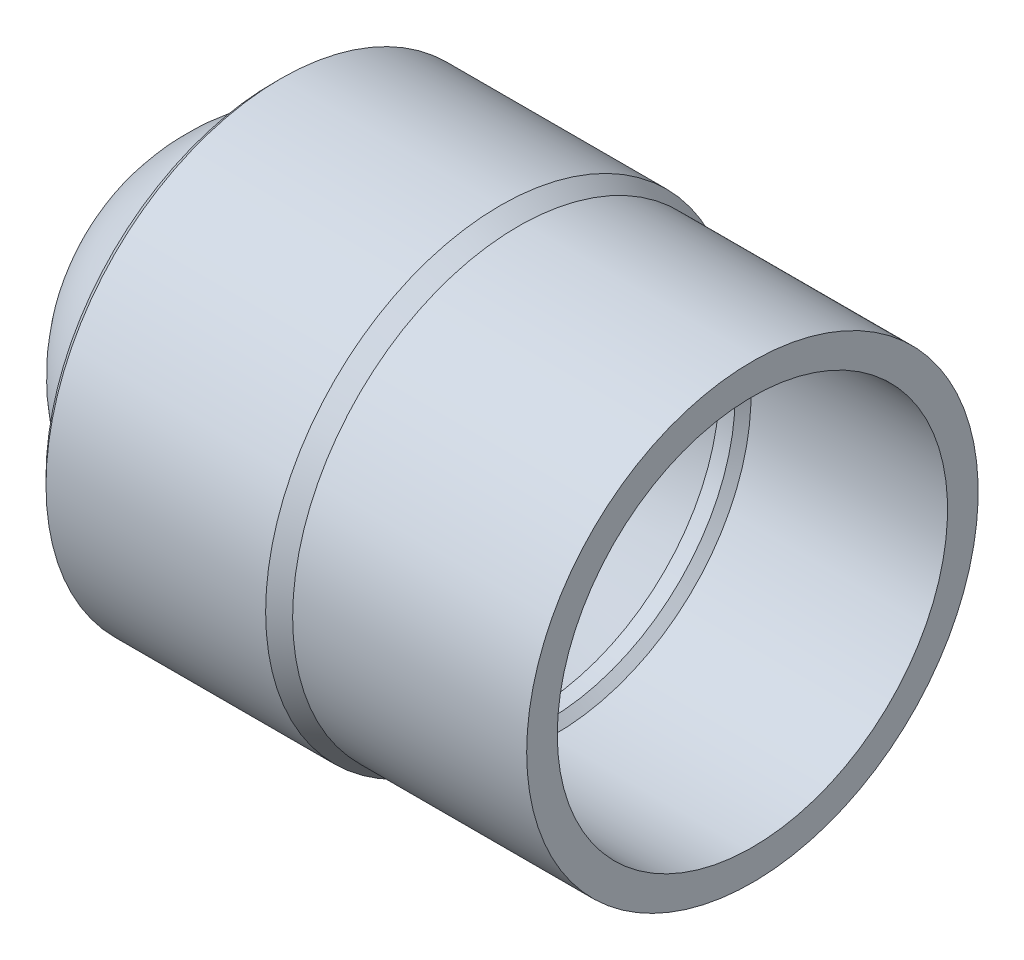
ISO-10303-21;
HEADER;
FILE_DESCRIPTION(('STEP AP214'),'2;1');
FILE_NAME('part.step','',(''),(''),'','','');
FILE_SCHEMA(('AUTOMOTIVE_DESIGN { 1 0 10303 214 1 1 1 1 }'));
ENDSEC;
DATA;
#1=APPLICATION_CONTEXT('core data for automotive mechanical design processes');
#2=APPLICATION_PROTOCOL_DEFINITION('international standard','automotive_design',2000,#1);
#3=PRODUCT_CONTEXT('',#1,'mechanical');
#4=PRODUCT('Part','Part','',(#3));
#5=PRODUCT_RELATED_PRODUCT_CATEGORY('part','',(#4));
#6=PRODUCT_DEFINITION_FORMATION('','',#4);
#7=PRODUCT_DEFINITION_CONTEXT('part definition',#1,'design');
#8=PRODUCT_DEFINITION('design','',#6,#7);
#9=PRODUCT_DEFINITION_SHAPE('','',#8);
#10=(LENGTH_UNIT() NAMED_UNIT(*) SI_UNIT(.MILLI.,.METRE.));
#11=(NAMED_UNIT(*) PLANE_ANGLE_UNIT() SI_UNIT($,.RADIAN.));
#12=(NAMED_UNIT(*) SI_UNIT($,.STERADIAN.) SOLID_ANGLE_UNIT());
#13=UNCERTAINTY_MEASURE_WITH_UNIT(LENGTH_MEASURE(1.E-05),#10,'distance_accuracy_value','');
#14=(GEOMETRIC_REPRESENTATION_CONTEXT(3) GLOBAL_UNCERTAINTY_ASSIGNED_CONTEXT((#13)) GLOBAL_UNIT_ASSIGNED_CONTEXT((#10,
#11,#12)) REPRESENTATION_CONTEXT('',''));
#15=CARTESIAN_POINT('',(0.,0.,0.));
#16=DIRECTION('',(0.,0.,1.));
#17=DIRECTION('',(1.,0.,0.));
#18=AXIS2_PLACEMENT_3D('',#15,#16,#17);
#19=CARTESIAN_POINT('',(0.,0.,0.));
#20=DIRECTION('',(-1.,0.,0.));
#21=DIRECTION('',(0.,0.,-1.));
#22=AXIS2_PLACEMENT_3D('',#19,#20,#21);
#23=SPHERICAL_SURFACE('',#22,70.104);
#24=CARTESIAN_POINT('',(0.,0.,0.));
#25=DIRECTION('',(-1.,0.,0.));
#26=DIRECTION('',(0.,0.,1.));
#27=AXIS2_PLACEMENT_3D('',#24,#25,#26);
#28=CIRCLE('',#27,70.104);
#29=CARTESIAN_POINT('',(0.,0.,70.104));
#30=VERTEX_POINT('',#29);
#31=EDGE_CURVE('E75',#30,#30,#28,.T.);
#32=ORIENTED_EDGE('',*,*,#31,.T.);
#33=EDGE_LOOP('',(#32));
#34=FACE_BOUND('',#33,.T.);
#35=ADVANCED_FACE('F32',(#34),#23,.T.);
#36=CARTESIAN_POINT('',(0.,0.,0.));
#37=DIRECTION('',(-1.,0.,0.));
#38=DIRECTION('',(0.,0.,1.));
#39=AXIS2_PLACEMENT_3D('',#36,#37,#38);
#40=SPHERICAL_SURFACE('',#39,57.404);
#41=CARTESIAN_POINT('',(0.,0.,0.));
#42=DIRECTION('',(-1.,0.,0.));
#43=DIRECTION('',(0.,0.,1.));
#44=AXIS2_PLACEMENT_3D('',#41,#42,#43);
#45=CIRCLE('',#44,57.404);
#46=CARTESIAN_POINT('',(0.,0.,57.404));
#47=VERTEX_POINT('',#46);
#48=EDGE_CURVE('E10',#47,#47,#45,.T.);
#49=ORIENTED_EDGE('',*,*,#48,.F.);
#50=EDGE_LOOP('',(#49));
#51=FACE_BOUND('',#50,.T.);
#52=ADVANCED_FACE('F147',(#51),#40,.F.);
#53=CARTESIAN_POINT('',(0.,0.,0.));
#54=DIRECTION('',(-1.,0.,0.));
#55=DIRECTION('',(0.,0.,1.));
#56=AXIS2_PLACEMENT_3D('',#53,#54,#55);
#57=CYLINDRICAL_SURFACE('',#56,57.404);
#58=CARTESIAN_POINT('',(54.61,0.,0.));
#59=DIRECTION('',(-1.,0.,0.));
#60=DIRECTION('',(0.,0.,1.));
#61=AXIS2_PLACEMENT_3D('',#58,#59,#60);
#62=CIRCLE('',#61,57.404);
#63=CARTESIAN_POINT('',(54.61,0.,57.404));
#64=VERTEX_POINT('',#63);
#65=EDGE_CURVE('E38',#64,#64,#62,.T.);
#66=ORIENTED_EDGE('',*,*,#65,.F.);
#67=EDGE_LOOP('',(#66));
#68=FACE_BOUND('',#67,.T.);
#69=ORIENTED_EDGE('',*,*,#48,.T.);
#70=EDGE_LOOP('',(#69));
#71=FACE_BOUND('',#70,.T.);
#72=ADVANCED_FACE('F142',(#68,#71),#57,.F.);
#73=CARTESIAN_POINT('',(54.61,0.,0.));
#74=DIRECTION('',(1.,0.,0.));
#75=DIRECTION('',(0.,0.,-1.));
#76=AXIS2_PLACEMENT_3D('',#73,#74,#75);
#77=CONICAL_SURFACE('',#76,57.404,0.457546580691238);
#78=CARTESIAN_POINT('',(72.1487,0.,0.));
#79=DIRECTION('',(-1.,0.,0.));
#80=DIRECTION('',(0.,0.,1.));
#81=AXIS2_PLACEMENT_3D('',#78,#79,#80);
#82=CIRCLE('',#81,66.04);
#83=CARTESIAN_POINT('',(72.1487,0.,66.04));
#84=VERTEX_POINT('',#83);
#85=EDGE_CURVE('E42',#84,#84,#82,.T.);
#86=ORIENTED_EDGE('',*,*,#85,.F.);
#87=EDGE_LOOP('',(#86));
#88=FACE_BOUND('',#87,.T.);
#89=ORIENTED_EDGE('',*,*,#65,.T.);
#90=EDGE_LOOP('',(#89));
#91=FACE_BOUND('',#90,.T.);
#92=ADVANCED_FACE('F137',(#88,#91),#77,.F.);
#93=CARTESIAN_POINT('',(0.,0.,0.));
#94=DIRECTION('',(-1.,0.,0.));
#95=DIRECTION('',(0.,0.,1.));
#96=AXIS2_PLACEMENT_3D('',#93,#94,#95);
#97=CYLINDRICAL_SURFACE('',#96,66.04);
#98=CARTESIAN_POINT('',(77.724,0.,0.));
#99=DIRECTION('',(-1.,0.,0.));
#100=DIRECTION('',(0.,0.,1.));
#101=AXIS2_PLACEMENT_3D('',#98,#99,#100);
#102=CIRCLE('',#101,66.04);
#103=CARTESIAN_POINT('',(77.724,0.,66.04));
#104=VERTEX_POINT('',#103);
#105=EDGE_CURVE('E46',#104,#104,#102,.T.);
#106=ORIENTED_EDGE('',*,*,#105,.F.);
#107=EDGE_LOOP('',(#106));
#108=FACE_BOUND('',#107,.T.);
#109=ORIENTED_EDGE('',*,*,#85,.T.);
#110=EDGE_LOOP('',(#109));
#111=FACE_BOUND('',#110,.T.);
#112=ADVANCED_FACE('F131',(#108,#111),#97,.F.);
#113=CARTESIAN_POINT('',(77.724,0.,0.));
#114=DIRECTION('',(1.,0.,0.));
#115=DIRECTION('',(0.,0.,-1.));
#116=AXIS2_PLACEMENT_3D('',#113,#114,#115);
#117=CONICAL_SURFACE('',#116,66.04,0.785398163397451);
#118=CARTESIAN_POINT('',(80.518,0.,0.));
#119=DIRECTION('',(-1.,0.,0.));
#120=DIRECTION('',(0.,0.,1.));
#121=AXIS2_PLACEMENT_3D('',#118,#119,#120);
#122=CIRCLE('',#121,68.834);
#123=CARTESIAN_POINT('',(80.518,0.,68.834));
#124=VERTEX_POINT('',#123);
#125=EDGE_CURVE('E51',#124,#124,#122,.T.);
#126=ORIENTED_EDGE('',*,*,#125,.F.);
#127=EDGE_LOOP('',(#126));
#128=FACE_BOUND('',#127,.T.);
#129=ORIENTED_EDGE('',*,*,#105,.T.);
#130=EDGE_LOOP('',(#129));
#131=FACE_BOUND('',#130,.T.);
#132=ADVANCED_FACE('F125',(#128,#131),#117,.F.);
#133=CARTESIAN_POINT('',(0.,0.,0.));
#134=DIRECTION('',(-1.,0.,0.));
#135=DIRECTION('',(0.,0.,1.));
#136=AXIS2_PLACEMENT_3D('',#133,#134,#135);
#137=CYLINDRICAL_SURFACE('',#136,68.834);
#138=CARTESIAN_POINT('',(149.86,0.,0.));
#139=DIRECTION('',(-1.,0.,0.));
#140=DIRECTION('',(0.,0.,1.));
#141=AXIS2_PLACEMENT_3D('',#138,#139,#140);
#142=CIRCLE('',#141,68.834);
#143=CARTESIAN_POINT('',(149.86,0.,68.834));
#144=VERTEX_POINT('',#143);
#145=EDGE_CURVE('E54',#144,#144,#142,.T.);
#146=ORIENTED_EDGE('',*,*,#145,.F.);
#147=EDGE_LOOP('',(#146));
#148=FACE_BOUND('',#147,.T.);
#149=ORIENTED_EDGE('',*,*,#125,.T.);
#150=EDGE_LOOP('',(#149));
#151=FACE_BOUND('',#150,.T.);
#152=ADVANCED_FACE('F119',(#148,#151),#137,.F.);
#153=CARTESIAN_POINT('',(149.86,0.,-79.6290000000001));
#154=DIRECTION('',(-1.,0.,0.));
#155=DIRECTION('',(0.,0.,1.));
#156=AXIS2_PLACEMENT_3D('',#153,#154,#155);
#157=PLANE('',#156);
#158=CARTESIAN_POINT('',(149.86,0.,0.));
#159=DIRECTION('',(-1.,0.,0.));
#160=DIRECTION('',(0.,0.,1.));
#161=AXIS2_PLACEMENT_3D('',#158,#159,#160);
#162=CIRCLE('',#161,79.6290000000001);
#163=CARTESIAN_POINT('',(149.86,0.,79.6290000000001));
#164=VERTEX_POINT('',#163);
#165=EDGE_CURVE('E57',#164,#164,#162,.T.);
#166=ORIENTED_EDGE('',*,*,#165,.F.);
#167=EDGE_LOOP('',(#166));
#168=FACE_BOUND('',#167,.T.);
#169=ORIENTED_EDGE('',*,*,#145,.T.);
#170=EDGE_LOOP('',(#169));
#171=FACE_BOUND('',#170,.T.);
#172=ADVANCED_FACE('F113',(#168,#171),#157,.F.);
#173=CARTESIAN_POINT('',(0.,0.,0.));
#174=DIRECTION('',(-1.,0.,0.));
#175=DIRECTION('',(0.,0.,1.));
#176=AXIS2_PLACEMENT_3D('',#173,#174,#175);
#177=CYLINDRICAL_SURFACE('',#176,79.6290000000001);
#178=CARTESIAN_POINT('',(67.31,0.,0.));
#179=DIRECTION('',(-1.,0.,0.));
#180=DIRECTION('',(0.,0.,1.));
#181=AXIS2_PLACEMENT_3D('',#178,#179,#180);
#182=CIRCLE('',#181,79.6290000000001);
#183=CARTESIAN_POINT('',(67.31,0.,79.6290000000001));
#184=VERTEX_POINT('',#183);
#185=EDGE_CURVE('E60',#184,#184,#182,.T.);
#186=ORIENTED_EDGE('',*,*,#185,.F.);
#187=EDGE_LOOP('',(#186));
#188=FACE_BOUND('',#187,.T.);
#189=ORIENTED_EDGE('',*,*,#165,.T.);
#190=EDGE_LOOP('',(#189));
#191=FACE_BOUND('',#190,.T.);
#192=ADVANCED_FACE('F107',(#188,#191),#177,.T.);
#193=CARTESIAN_POINT('',(67.31,0.,0.));
#194=DIRECTION('',(-1.,0.,0.));
#195=DIRECTION('',(0.,0.,1.));
#196=AXIS2_PLACEMENT_3D('',#193,#194,#195);
#197=CONICAL_SURFACE('',#196,79.6290000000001,0.463647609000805);
#198=CARTESIAN_POINT('',(60.96,0.,0.));
#199=DIRECTION('',(-1.,0.,0.));
#200=DIRECTION('',(0.,0.,1.));
#201=AXIS2_PLACEMENT_3D('',#198,#199,#200);
#202=CIRCLE('',#201,82.804);
#203=CARTESIAN_POINT('',(60.96,0.,82.804));
#204=VERTEX_POINT('',#203);
#205=EDGE_CURVE('E63',#204,#204,#202,.T.);
#206=ORIENTED_EDGE('',*,*,#205,.F.);
#207=EDGE_LOOP('',(#206));
#208=FACE_BOUND('',#207,.T.);
#209=ORIENTED_EDGE('',*,*,#185,.T.);
#210=EDGE_LOOP('',(#209));
#211=FACE_BOUND('',#210,.T.);
#212=ADVANCED_FACE('F101',(#208,#211),#197,.T.);
#213=CARTESIAN_POINT('',(0.,0.,0.));
#214=DIRECTION('',(-1.,0.,0.));
#215=DIRECTION('',(0.,0.,1.));
#216=AXIS2_PLACEMENT_3D('',#213,#214,#215);
#217=CYLINDRICAL_SURFACE('',#216,82.804);
#218=CARTESIAN_POINT('',(-16.51,0.,0.));
#219=DIRECTION('',(-1.,0.,0.));
#220=DIRECTION('',(0.,0.,1.));
#221=AXIS2_PLACEMENT_3D('',#218,#219,#220);
#222=CIRCLE('',#221,82.804);
#223=CARTESIAN_POINT('',(-16.51,0.,82.804));
#224=VERTEX_POINT('',#223);
#225=EDGE_CURVE('E66',#224,#224,#222,.T.);
#226=ORIENTED_EDGE('',*,*,#225,.F.);
#227=EDGE_LOOP('',(#226));
#228=FACE_BOUND('',#227,.T.);
#229=ORIENTED_EDGE('',*,*,#205,.T.);
#230=EDGE_LOOP('',(#229));
#231=FACE_BOUND('',#230,.T.);
#232=ADVANCED_FACE('F95',(#228,#231),#217,.T.);
#233=CARTESIAN_POINT('',(-16.51,0.,0.));
#234=DIRECTION('',(1.,0.,0.));
#235=DIRECTION('',(0.,0.,-1.));
#236=AXIS2_PLACEMENT_3D('',#233,#234,#235);
#237=CONICAL_SURFACE('',#236,82.804,0.785398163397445);
#238=CARTESIAN_POINT('',(-19.05,0.,0.));
#239=DIRECTION('',(-1.,0.,0.));
#240=DIRECTION('',(0.,0.,1.));
#241=AXIS2_PLACEMENT_3D('',#238,#239,#240);
#242=CIRCLE('',#241,80.264);
#243=CARTESIAN_POINT('',(-19.05,0.,80.264));
#244=VERTEX_POINT('',#243);
#245=EDGE_CURVE('E69',#244,#244,#242,.T.);
#246=ORIENTED_EDGE('',*,*,#245,.F.);
#247=EDGE_LOOP('',(#246));
#248=FACE_BOUND('',#247,.T.);
#249=ORIENTED_EDGE('',*,*,#225,.T.);
#250=EDGE_LOOP('',(#249));
#251=FACE_BOUND('',#250,.T.);
#252=ADVANCED_FACE('F89',(#248,#251),#237,.T.);
#253=CARTESIAN_POINT('',(-19.05,0.,-70.104));
#254=DIRECTION('',(1.,0.,0.));
#255=DIRECTION('',(0.,0.,-1.));
#256=AXIS2_PLACEMENT_3D('',#253,#254,#255);
#257=PLANE('',#256);
#258=CARTESIAN_POINT('',(-19.05,0.,0.));
#259=DIRECTION('',(-1.,0.,0.));
#260=DIRECTION('',(0.,0.,1.));
#261=AXIS2_PLACEMENT_3D('',#258,#259,#260);
#262=CIRCLE('',#261,70.104);
#263=CARTESIAN_POINT('',(-19.05,0.,70.104));
#264=VERTEX_POINT('',#263);
#265=EDGE_CURVE('E72',#264,#264,#262,.T.);
#266=ORIENTED_EDGE('',*,*,#265,.F.);
#267=EDGE_LOOP('',(#266));
#268=FACE_BOUND('',#267,.T.);
#269=ORIENTED_EDGE('',*,*,#245,.T.);
#270=EDGE_LOOP('',(#269));
#271=FACE_BOUND('',#270,.T.);
#272=ADVANCED_FACE('F83',(#268,#271),#257,.F.);
#273=CARTESIAN_POINT('',(0.,0.,0.));
#274=DIRECTION('',(-1.,0.,0.));
#275=DIRECTION('',(0.,0.,1.));
#276=AXIS2_PLACEMENT_3D('',#273,#274,#275);
#277=CYLINDRICAL_SURFACE('',#276,70.104);
#278=ORIENTED_EDGE('',*,*,#31,.F.);
#279=EDGE_LOOP('',(#278));
#280=FACE_BOUND('',#279,.T.);
#281=ORIENTED_EDGE('',*,*,#265,.T.);
#282=EDGE_LOOP('',(#281));
#283=FACE_BOUND('',#282,.T.);
#284=ADVANCED_FACE('F80',(#280,#283),#277,.F.);
#285=CLOSED_SHELL('',(#35,#52,#72,#92,#112,#132,#152,#172,#192,#212,#232,#252,#272,#284));
#286=MANIFOLD_SOLID_BREP('B2',#285);
#287=ADVANCED_BREP_SHAPE_REPRESENTATION('',(#18,#286),#14);
#288=SHAPE_DEFINITION_REPRESENTATION(#9,#287);
ENDSEC;
END-ISO-10303-21;
